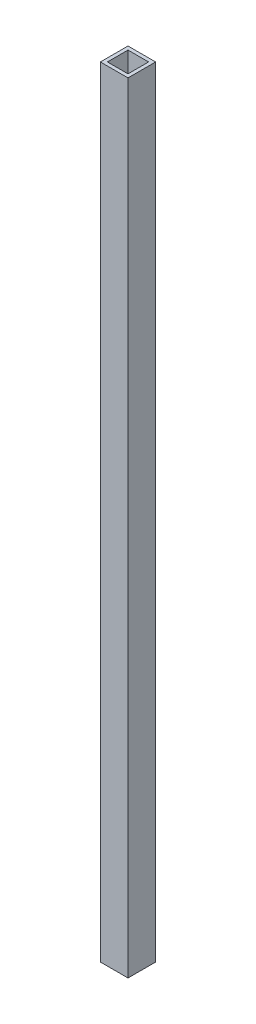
ISO-10303-21;
HEADER;
FILE_DESCRIPTION(('STEP AP214'),'2;1');
FILE_NAME('part.step','',(''),(''),'','','');
FILE_SCHEMA(('AUTOMOTIVE_DESIGN { 1 0 10303 214 1 1 1 1 }'));
ENDSEC;
DATA;
#1=APPLICATION_CONTEXT('core data for automotive mechanical design processes');
#2=APPLICATION_PROTOCOL_DEFINITION('international standard','automotive_design',2000,#1);
#3=PRODUCT_CONTEXT('',#1,'mechanical');
#4=PRODUCT('Part','Part','',(#3));
#5=PRODUCT_RELATED_PRODUCT_CATEGORY('part','',(#4));
#6=PRODUCT_DEFINITION_FORMATION('','',#4);
#7=PRODUCT_DEFINITION_CONTEXT('part definition',#1,'design');
#8=PRODUCT_DEFINITION('design','',#6,#7);
#9=PRODUCT_DEFINITION_SHAPE('','',#8);
#10=(LENGTH_UNIT() NAMED_UNIT(*) SI_UNIT(.MILLI.,.METRE.));
#11=(NAMED_UNIT(*) PLANE_ANGLE_UNIT() SI_UNIT($,.RADIAN.));
#12=(NAMED_UNIT(*) SI_UNIT($,.STERADIAN.) SOLID_ANGLE_UNIT());
#13=UNCERTAINTY_MEASURE_WITH_UNIT(LENGTH_MEASURE(1.E-05),#10,'distance_accuracy_value','');
#14=(GEOMETRIC_REPRESENTATION_CONTEXT(3) GLOBAL_UNCERTAINTY_ASSIGNED_CONTEXT((#13)) GLOBAL_UNIT_ASSIGNED_CONTEXT((#10,
#11,#12)) REPRESENTATION_CONTEXT('',''));
#15=CARTESIAN_POINT('',(0.,0.,0.));
#16=DIRECTION('',(0.,0.,1.));
#17=DIRECTION('',(1.,0.,0.));
#18=AXIS2_PLACEMENT_3D('',#15,#16,#17);
#19=CARTESIAN_POINT('',(0.,355.6,0.));
#20=DIRECTION('',(0.,-1.,0.));
#21=DIRECTION('',(0.,0.,-1.));
#22=AXIS2_PLACEMENT_3D('',#19,#20,#21);
#23=PLANE('',#22);
#24=DIRECTION('',(0.,0.,1.));
#25=VECTOR('',#24,1.);
#26=CARTESIAN_POINT('',(0.,355.6,0.));
#27=LINE('',#26,#25);
#28=CARTESIAN_POINT('',(0.,355.6,-12.6));
#29=VERTEX_POINT('',#28);
#30=CARTESIAN_POINT('',(0.,355.6,0.));
#31=VERTEX_POINT('',#30);
#32=EDGE_CURVE('E134',#29,#31,#27,.T.);
#33=ORIENTED_EDGE('',*,*,#32,.T.);
#34=DIRECTION('',(1.,0.,0.));
#35=VECTOR('',#34,1.);
#36=CARTESIAN_POINT('',(0.,355.6,0.));
#37=LINE('',#36,#35);
#38=CARTESIAN_POINT('',(12.6,355.6,0.));
#39=VERTEX_POINT('',#38);
#40=EDGE_CURVE('E137',#31,#39,#37,.T.);
#41=ORIENTED_EDGE('',*,*,#40,.T.);
#42=DIRECTION('',(0.,0.,-1.));
#43=VECTOR('',#42,1.);
#44=CARTESIAN_POINT('',(12.6,355.6,0.));
#45=LINE('',#44,#43);
#46=CARTESIAN_POINT('',(12.6,355.6,-12.6));
#47=VERTEX_POINT('',#46);
#48=EDGE_CURVE('E140',#39,#47,#45,.T.);
#49=ORIENTED_EDGE('',*,*,#48,.T.);
#50=DIRECTION('',(-1.,0.,0.));
#51=VECTOR('',#50,1.);
#52=CARTESIAN_POINT('',(0.,355.6,-12.6));
#53=LINE('',#52,#51);
#54=EDGE_CURVE('E142',#47,#29,#53,.T.);
#55=ORIENTED_EDGE('',*,*,#54,.T.);
#56=EDGE_LOOP('',(#33,#41,#49,#55));
#57=FACE_BOUND('',#56,.T.);
#58=DIRECTION('',(0.,0.,1.));
#59=VECTOR('',#58,1.);
#60=CARTESIAN_POINT('',(1.6,355.6,-1.6));
#61=LINE('',#60,#59);
#62=CARTESIAN_POINT('',(1.6,355.6,-11.));
#63=VERTEX_POINT('',#62);
#64=CARTESIAN_POINT('',(1.6,355.6,-1.6));
#65=VERTEX_POINT('',#64);
#66=EDGE_CURVE('E98',#63,#65,#61,.T.);
#67=ORIENTED_EDGE('',*,*,#66,.F.);
#68=DIRECTION('',(-1.,0.,0.));
#69=VECTOR('',#68,1.);
#70=CARTESIAN_POINT('',(1.6,355.6,-11.));
#71=LINE('',#70,#69);
#72=CARTESIAN_POINT('',(11.,355.6,-11.));
#73=VERTEX_POINT('',#72);
#74=EDGE_CURVE('E120',#73,#63,#71,.T.);
#75=ORIENTED_EDGE('',*,*,#74,.F.);
#76=DIRECTION('',(0.,0.,-1.));
#77=VECTOR('',#76,1.);
#78=CARTESIAN_POINT('',(11.,355.6,-1.6));
#79=LINE('',#78,#77);
#80=CARTESIAN_POINT('',(11.,355.6,-1.6));
#81=VERTEX_POINT('',#80);
#82=EDGE_CURVE('E118',#81,#73,#79,.T.);
#83=ORIENTED_EDGE('',*,*,#82,.F.);
#84=DIRECTION('',(1.,0.,0.));
#85=VECTOR('',#84,1.);
#86=CARTESIAN_POINT('',(1.6,355.6,-1.6));
#87=LINE('',#86,#85);
#88=EDGE_CURVE('E106',#65,#81,#87,.T.);
#89=ORIENTED_EDGE('',*,*,#88,.F.);
#90=EDGE_LOOP('',(#67,#75,#83,#89));
#91=FACE_BOUND('',#90,.T.);
#92=ADVANCED_FACE('F33',(#57,#91),#23,.F.);
#93=CARTESIAN_POINT('',(0.,0.,0.));
#94=DIRECTION('',(0.,-1.,0.));
#95=DIRECTION('',(0.,0.,-1.));
#96=AXIS2_PLACEMENT_3D('',#93,#94,#95);
#97=PLANE('',#96);
#98=DIRECTION('',(0.,0.,1.));
#99=VECTOR('',#98,1.);
#100=CARTESIAN_POINT('',(0.,0.,0.));
#101=LINE('',#100,#99);
#102=CARTESIAN_POINT('',(0.,0.,-12.6));
#103=VERTEX_POINT('',#102);
#104=CARTESIAN_POINT('',(0.,0.,0.));
#105=VERTEX_POINT('',#104);
#106=EDGE_CURVE('E114',#103,#105,#101,.T.);
#107=ORIENTED_EDGE('',*,*,#106,.F.);
#108=DIRECTION('',(-1.,0.,0.));
#109=VECTOR('',#108,1.);
#110=CARTESIAN_POINT('',(0.,0.,-12.6));
#111=LINE('',#110,#109);
#112=CARTESIAN_POINT('',(12.6,0.,-12.6));
#113=VERTEX_POINT('',#112);
#114=EDGE_CURVE('E138',#113,#103,#111,.T.);
#115=ORIENTED_EDGE('',*,*,#114,.F.);
#116=DIRECTION('',(0.,0.,-1.));
#117=VECTOR('',#116,1.);
#118=CARTESIAN_POINT('',(12.6,0.,0.));
#119=LINE('',#118,#117);
#120=CARTESIAN_POINT('',(12.6,0.,0.));
#121=VERTEX_POINT('',#120);
#122=EDGE_CURVE('E149',#121,#113,#119,.T.);
#123=ORIENTED_EDGE('',*,*,#122,.F.);
#124=DIRECTION('',(1.,0.,0.));
#125=VECTOR('',#124,1.);
#126=CARTESIAN_POINT('',(0.,0.,0.));
#127=LINE('',#126,#125);
#128=EDGE_CURVE('E147',#105,#121,#127,.T.);
#129=ORIENTED_EDGE('',*,*,#128,.F.);
#130=EDGE_LOOP('',(#107,#115,#123,#129));
#131=FACE_BOUND('',#130,.T.);
#132=DIRECTION('',(-1.,0.,0.));
#133=VECTOR('',#132,1.);
#134=CARTESIAN_POINT('',(1.6,0.,-11.));
#135=LINE('',#134,#133);
#136=CARTESIAN_POINT('',(11.,0.,-11.));
#137=VERTEX_POINT('',#136);
#138=CARTESIAN_POINT('',(1.6,0.,-11.));
#139=VERTEX_POINT('',#138);
#140=EDGE_CURVE('E107',#137,#139,#135,.T.);
#141=ORIENTED_EDGE('',*,*,#140,.T.);
#142=DIRECTION('',(0.,0.,1.));
#143=VECTOR('',#142,1.);
#144=CARTESIAN_POINT('',(1.6,0.,-1.6));
#145=LINE('',#144,#143);
#146=CARTESIAN_POINT('',(1.6,0.,-1.6));
#147=VERTEX_POINT('',#146);
#148=EDGE_CURVE('E56',#139,#147,#145,.T.);
#149=ORIENTED_EDGE('',*,*,#148,.T.);
#150=DIRECTION('',(1.,0.,0.));
#151=VECTOR('',#150,1.);
#152=CARTESIAN_POINT('',(1.6,0.,-1.6));
#153=LINE('',#152,#151);
#154=CARTESIAN_POINT('',(11.,0.,-1.6));
#155=VERTEX_POINT('',#154);
#156=EDGE_CURVE('E113',#147,#155,#153,.T.);
#157=ORIENTED_EDGE('',*,*,#156,.T.);
#158=DIRECTION('',(0.,0.,-1.));
#159=VECTOR('',#158,1.);
#160=CARTESIAN_POINT('',(11.,0.,-1.6));
#161=LINE('',#160,#159);
#162=EDGE_CURVE('E126',#155,#137,#161,.T.);
#163=ORIENTED_EDGE('',*,*,#162,.T.);
#164=EDGE_LOOP('',(#141,#149,#157,#163));
#165=FACE_BOUND('',#164,.T.);
#166=ADVANCED_FACE('F167',(#131,#165),#97,.T.);
#167=CARTESIAN_POINT('',(0.,355.6,0.));
#168=DIRECTION('',(1.,0.,0.));
#169=DIRECTION('',(0.,0.,-1.));
#170=AXIS2_PLACEMENT_3D('',#167,#168,#169);
#171=PLANE('',#170);
#172=ORIENTED_EDGE('',*,*,#106,.T.);
#173=DIRECTION('',(0.,-1.,0.));
#174=VECTOR('',#173,1.);
#175=CARTESIAN_POINT('',(0.,355.6,0.));
#176=LINE('',#175,#174);
#177=EDGE_CURVE('E11',#31,#105,#176,.T.);
#178=ORIENTED_EDGE('',*,*,#177,.F.);
#179=ORIENTED_EDGE('',*,*,#32,.F.);
#180=DIRECTION('',(0.,-1.,0.));
#181=VECTOR('',#180,1.);
#182=CARTESIAN_POINT('',(0.,355.6,-12.6));
#183=LINE('',#182,#181);
#184=EDGE_CURVE('E144',#29,#103,#183,.T.);
#185=ORIENTED_EDGE('',*,*,#184,.T.);
#186=EDGE_LOOP('',(#172,#178,#179,#185));
#187=FACE_BOUND('',#186,.T.);
#188=ADVANCED_FACE('F35',(#187),#171,.F.);
#189=CARTESIAN_POINT('',(0.,355.6,0.));
#190=DIRECTION('',(0.,0.,-1.));
#191=DIRECTION('',(-1.,0.,0.));
#192=AXIS2_PLACEMENT_3D('',#189,#190,#191);
#193=PLANE('',#192);
#194=ORIENTED_EDGE('',*,*,#128,.T.);
#195=DIRECTION('',(0.,-1.,0.));
#196=VECTOR('',#195,1.);
#197=CARTESIAN_POINT('',(12.6,355.6,0.));
#198=LINE('',#197,#196);
#199=EDGE_CURVE('E41',#39,#121,#198,.T.);
#200=ORIENTED_EDGE('',*,*,#199,.F.);
#201=ORIENTED_EDGE('',*,*,#40,.F.);
#202=ORIENTED_EDGE('',*,*,#177,.T.);
#203=EDGE_LOOP('',(#194,#200,#201,#202));
#204=FACE_BOUND('',#203,.T.);
#205=ADVANCED_FACE('F177',(#204),#193,.F.);
#206=CARTESIAN_POINT('',(12.6,355.6,0.));
#207=DIRECTION('',(-1.,0.,0.));
#208=DIRECTION('',(0.,0.,1.));
#209=AXIS2_PLACEMENT_3D('',#206,#207,#208);
#210=PLANE('',#209);
#211=ORIENTED_EDGE('',*,*,#122,.T.);
#212=DIRECTION('',(0.,-1.,0.));
#213=VECTOR('',#212,1.);
#214=CARTESIAN_POINT('',(12.6,355.6,-12.6));
#215=LINE('',#214,#213);
#216=EDGE_CURVE('E154',#47,#113,#215,.T.);
#217=ORIENTED_EDGE('',*,*,#216,.F.);
#218=ORIENTED_EDGE('',*,*,#48,.F.);
#219=ORIENTED_EDGE('',*,*,#199,.T.);
#220=EDGE_LOOP('',(#211,#217,#218,#219));
#221=FACE_BOUND('',#220,.T.);
#222=ADVANCED_FACE('F161',(#221),#210,.F.);
#223=CARTESIAN_POINT('',(0.,355.6,-12.6));
#224=DIRECTION('',(0.,0.,1.));
#225=DIRECTION('',(1.,0.,0.));
#226=AXIS2_PLACEMENT_3D('',#223,#224,#225);
#227=PLANE('',#226);
#228=ORIENTED_EDGE('',*,*,#114,.T.);
#229=ORIENTED_EDGE('',*,*,#184,.F.);
#230=ORIENTED_EDGE('',*,*,#54,.F.);
#231=ORIENTED_EDGE('',*,*,#216,.T.);
#232=EDGE_LOOP('',(#228,#229,#230,#231));
#233=FACE_BOUND('',#232,.T.);
#234=ADVANCED_FACE('F171',(#233),#227,.F.);
#235=CARTESIAN_POINT('',(1.6,355.6,-1.6));
#236=DIRECTION('',(1.,0.,0.));
#237=DIRECTION('',(0.,0.,-1.));
#238=AXIS2_PLACEMENT_3D('',#235,#236,#237);
#239=PLANE('',#238);
#240=ORIENTED_EDGE('',*,*,#148,.F.);
#241=DIRECTION('',(0.,-1.,0.));
#242=VECTOR('',#241,1.);
#243=CARTESIAN_POINT('',(1.6,355.6,-11.));
#244=LINE('',#243,#242);
#245=EDGE_CURVE('E102',#63,#139,#244,.T.);
#246=ORIENTED_EDGE('',*,*,#245,.F.);
#247=ORIENTED_EDGE('',*,*,#66,.T.);
#248=DIRECTION('',(0.,-1.,0.));
#249=VECTOR('',#248,1.);
#250=CARTESIAN_POINT('',(1.6,355.6,-1.6));
#251=LINE('',#250,#249);
#252=EDGE_CURVE('E101',#65,#147,#251,.T.);
#253=ORIENTED_EDGE('',*,*,#252,.T.);
#254=EDGE_LOOP('',(#240,#246,#247,#253));
#255=FACE_BOUND('',#254,.T.);
#256=ADVANCED_FACE('F100',(#255),#239,.T.);
#257=CARTESIAN_POINT('',(1.6,355.6,-1.6));
#258=DIRECTION('',(0.,0.,-1.));
#259=DIRECTION('',(-1.,0.,0.));
#260=AXIS2_PLACEMENT_3D('',#257,#258,#259);
#261=PLANE('',#260);
#262=ORIENTED_EDGE('',*,*,#156,.F.);
#263=ORIENTED_EDGE('',*,*,#252,.F.);
#264=ORIENTED_EDGE('',*,*,#88,.T.);
#265=DIRECTION('',(0.,-1.,0.));
#266=VECTOR('',#265,1.);
#267=CARTESIAN_POINT('',(11.,355.6,-1.6));
#268=LINE('',#267,#266);
#269=EDGE_CURVE('E115',#81,#155,#268,.T.);
#270=ORIENTED_EDGE('',*,*,#269,.T.);
#271=EDGE_LOOP('',(#262,#263,#264,#270));
#272=FACE_BOUND('',#271,.T.);
#273=ADVANCED_FACE('F110',(#272),#261,.T.);
#274=CARTESIAN_POINT('',(11.,355.6,-1.6));
#275=DIRECTION('',(-1.,0.,0.));
#276=DIRECTION('',(0.,0.,1.));
#277=AXIS2_PLACEMENT_3D('',#274,#275,#276);
#278=PLANE('',#277);
#279=ORIENTED_EDGE('',*,*,#162,.F.);
#280=ORIENTED_EDGE('',*,*,#269,.F.);
#281=ORIENTED_EDGE('',*,*,#82,.T.);
#282=DIRECTION('',(0.,-1.,0.));
#283=VECTOR('',#282,1.);
#284=CARTESIAN_POINT('',(11.,355.6,-11.));
#285=LINE('',#284,#283);
#286=EDGE_CURVE('E48',#73,#137,#285,.T.);
#287=ORIENTED_EDGE('',*,*,#286,.T.);
#288=EDGE_LOOP('',(#279,#280,#281,#287));
#289=FACE_BOUND('',#288,.T.);
#290=ADVANCED_FACE('F200',(#289),#278,.T.);
#291=CARTESIAN_POINT('',(1.6,355.6,-11.));
#292=DIRECTION('',(0.,0.,1.));
#293=DIRECTION('',(1.,0.,0.));
#294=AXIS2_PLACEMENT_3D('',#291,#292,#293);
#295=PLANE('',#294);
#296=ORIENTED_EDGE('',*,*,#140,.F.);
#297=ORIENTED_EDGE('',*,*,#286,.F.);
#298=ORIENTED_EDGE('',*,*,#74,.T.);
#299=ORIENTED_EDGE('',*,*,#245,.T.);
#300=EDGE_LOOP('',(#296,#297,#298,#299));
#301=FACE_BOUND('',#300,.T.);
#302=ADVANCED_FACE('F204',(#301),#295,.T.);
#303=CLOSED_SHELL('',(#92,#166,#188,#205,#222,#234,#256,#273,#290,#302));
#304=MANIFOLD_SOLID_BREP('B2',#303);
#305=ADVANCED_BREP_SHAPE_REPRESENTATION('',(#18,#304),#14);
#306=SHAPE_DEFINITION_REPRESENTATION(#9,#305);
ENDSEC;
END-ISO-10303-21;
